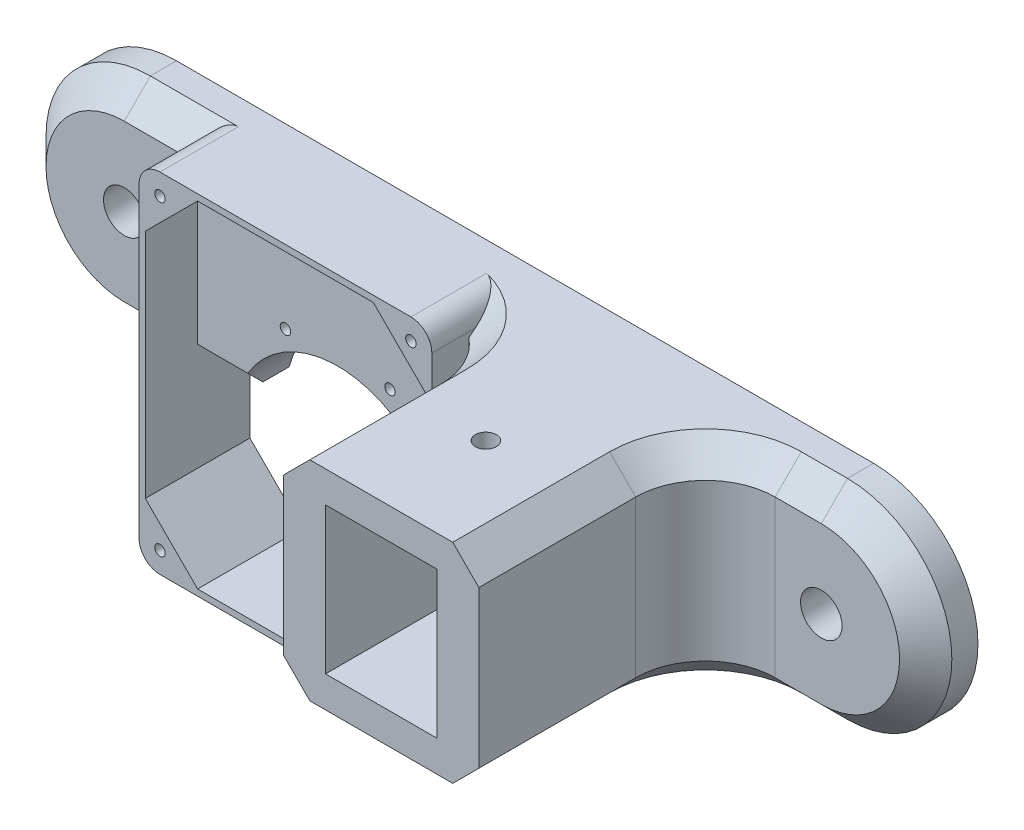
from build123d import *

# Parameters (mm, degrees)
ESQUISSE1_R                  = 5.95
ESQUISSE1_W                  = 32
ESQUISSE1_H                  = 42
BOSS_EXTRU_1_DEPTH           = 80
ENL_V_MAT_EXTRU_1_DEPTH      = 156.707755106
ENL_V_MAT_EXTRU_1_DEPTH_BACK = 156.707755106
ESQUISSE3_R                  = 3
CHANFREIN1_SIZE              = 7.5
ESQUISSE4_R                  = 30
ESQUISSE4_R_2                = 1.5
ENL_V_MAT_EXTRU_2_DEPTH      = 149.559432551
ESQUISSE5_R                  = 1.5
BOSS_EXTRU_2_DEPTH           = 30


with BuildPart() as part:
    # Esquisse1 → Boss.-Extru.1 (new body)
    with BuildSketch(Plane.XY):
        with BuildLine():
            Line((100, -30.95), (86.75, -30.95))
            Line((86.75, -30.95), (-9.25, -30.95))
            Line((-9.25, -30.95), (-100, -30.95))
            ThreePointArc((-100, -30.95), (-129.95, -1), (-100, 28.95))
            Line((-100, 28.95), (100, 28.95))
            ThreePointArc((100, 28.95), (129.95, -1), (100, -30.95))
        make_face()
        with Locations((-100, -1)):
            Circle(ESQUISSE1_R, mode=Mode.SUBTRACT)
        with Locations(Location((100, -1, 0), (0, 0, 180))):
            Circle(ESQUISSE1_R, mode=Mode.SUBTRACT)
        with Locations((38.75, -1)):
            Rectangle(ESQUISSE1_W, ESQUISSE1_H, mode=Mode.SUBTRACT)
    extrude(amount=BOSS_EXTRU_1_DEPTH)

    # Esquisse3 → Enl_v. mat.-Extru.1 (cut, two sides: drawn at the far end of the back side and taken through both)
    with BuildSketch(Plane(origin=(0, 0, 0), x_dir=(1, 0, 0), z_dir=(0, 1, 0)).offset(-ENL_V_MAT_EXTRU_1_DEPTH_BACK)):
        with Locations(Location((38.75, -50, 0), (0, 0, 270))):
            Circle(ESQUISSE3_R)
        with BuildLine():
            Line((-129.95, -80), (10.75, -80))
            Line((10.75, -80), (10.75, -35))
            ThreePointArc((10.75, -35), (4.892135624, -20.857864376), (-9.25, -15))
            Line((-9.25, -15), (-129.95, -15))
            Line((-129.95, -15), (-129.95, -80))
        make_face()
        with BuildLine():
            Line((129.95, -80), (66.75, -80))
            Line((66.75, -80), (66.75, -35))
            ThreePointArc((66.75, -35), (72.607864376, -20.857864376), (86.75, -15))
            Line((86.75, -15), (129.95, -15))
            Line((129.95, -15), (129.95, -80))
        make_face()
    extrude(amount=ENL_V_MAT_EXTRU_1_DEPTH + ENL_V_MAT_EXTRU_1_DEPTH_BACK, mode=Mode.SUBTRACT)

    # Chanfrein1
    chanfrein1_edges = [part.edges().sort_by_distance(p)[0] for p in [
        (10.75, 28.95, 57.5),
        (4.892135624, 28.95, 20.857864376),
        (-54.625, 28.95, 15),
        (-129.95, -1, 15),
        (-54.625, -30.95, 15),
        (4.892135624, -30.95, 20.857864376),
        (10.75, -30.95, 57.5),
        (93.375, 28.95, 15),
        (72.607864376, 28.95, 20.857864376),
        (66.75, 28.95, 57.5),
        (129.95, -1, 15),
        (93.375, -30.95, 15),
        (66.75, -30.95, 57.5),
        (72.607864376, -30.95, 20.857864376),
    ]]
    chamfer(chanfrein1_edges, length=CHANFREIN1_SIZE)

    # Esquisse4 → Enl_v. mat.-Extru.2 (cut, through all)
    with BuildSketch(Plane.XY.offset(15)):
        with Locations((-38.75, -38.75)):
            Circle(ESQUISSE4_R)
        with Locations((-53.75, 18.95)):
            Circle(ESQUISSE4_R_2)
        with Locations((-23.75, 18.95)):
            Circle(ESQUISSE4_R_2)
        with Locations((-23.75, -7.05)):
            Circle(ESQUISSE4_R_2)
        with Locations((-53.75, -7.05)):
            Circle(ESQUISSE4_R_2)
    extrude(amount=-ENL_V_MAT_EXTRU_2_DEPTH, mode=Mode.SUBTRACT)

    # Esquisse5 → Boss.-Extru.2 (add)
    with BuildSketch(Plane(origin=(0, 0, 0), x_dir=(-1, 0, 0), z_dir=(0, 0, -1))):
        with BuildLine():
            Line((74.75, -71.05), (2.75, -71.05))
            ThreePointArc((2.75, -71.05), (-1.492640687, -69.292640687), (-3.25, -65.05))
            Line((-3.25, -65.05), (-3.25, 22.95))
            ThreePointArc((-3.25, 22.95), (-1.492640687, 27.192640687), (2.75, 28.95))
            Line((2.75, 28.95), (74.75, 28.95))
            ThreePointArc((74.75, 28.95), (78.992640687, 27.192640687), (80.75, 22.95))
            Line((80.75, 22.95), (80.75, -65.05))
            ThreePointArc((80.75, -65.05), (78.992640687, -69.292640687), (74.75, -71.05))
        make_face()
        with Locations((74.75, 22.95)):
            Circle(ESQUISSE5_R, mode=Mode.SUBTRACT)
        with Locations((2.75, 22.95)):
            Circle(ESQUISSE5_R, mode=Mode.SUBTRACT)
        with Locations((2.75, -65.05)):
            Circle(ESQUISSE5_R, mode=Mode.SUBTRACT)
        with Locations((74.75, -65.05)):
            Circle(ESQUISSE5_R, mode=Mode.SUBTRACT)
        Polygon((78.95, -54.25), (78.95, 12.15), (63.95, 27.15), (13.55, 27.15), (-1.45, 12.15), (-1.45, -54.25), (13.55, -69.25), (63.95, -69.25), align=None, mode=Mode.SUBTRACT)
    extrude(amount=-BOSS_EXTRU_2_DEPTH)


solid = part.part
